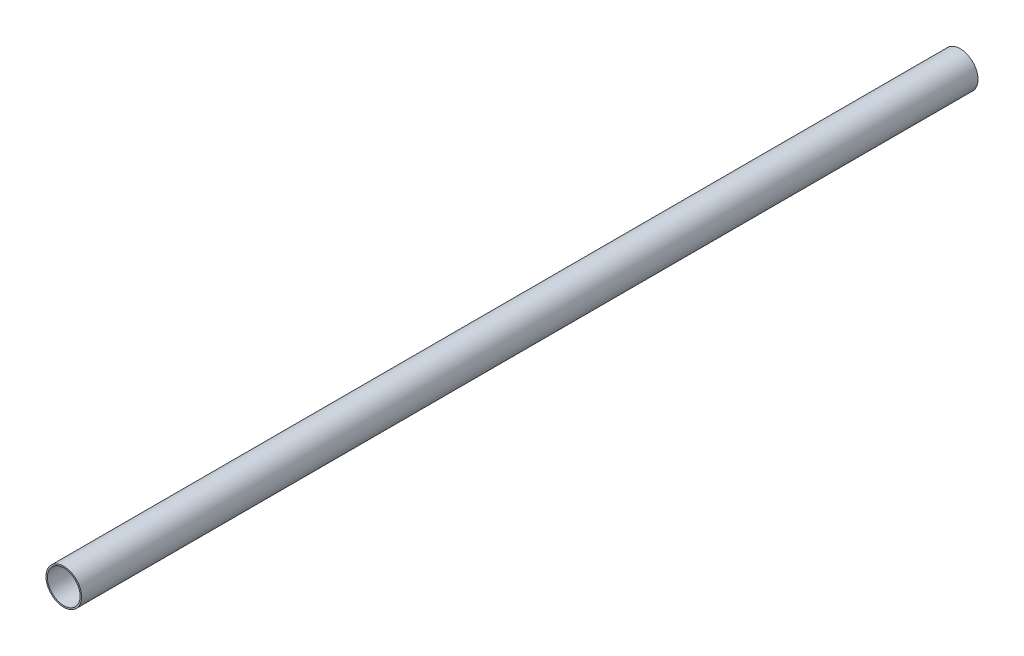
ISO-10303-21;
HEADER;
FILE_DESCRIPTION(('STEP AP214'),'2;1');
FILE_NAME('part.step','',(''),(''),'','','');
FILE_SCHEMA(('AUTOMOTIVE_DESIGN { 1 0 10303 214 1 1 1 1 }'));
ENDSEC;
DATA;
#1=APPLICATION_CONTEXT('core data for automotive mechanical design processes');
#2=APPLICATION_PROTOCOL_DEFINITION('international standard','automotive_design',2000,#1);
#3=PRODUCT_CONTEXT('',#1,'mechanical');
#4=PRODUCT('Part','Part','',(#3));
#5=PRODUCT_RELATED_PRODUCT_CATEGORY('part','',(#4));
#6=PRODUCT_DEFINITION_FORMATION('','',#4);
#7=PRODUCT_DEFINITION_CONTEXT('part definition',#1,'design');
#8=PRODUCT_DEFINITION('design','',#6,#7);
#9=PRODUCT_DEFINITION_SHAPE('','',#8);
#10=(LENGTH_UNIT() NAMED_UNIT(*) SI_UNIT(.MILLI.,.METRE.));
#11=(NAMED_UNIT(*) PLANE_ANGLE_UNIT() SI_UNIT($,.RADIAN.));
#12=(NAMED_UNIT(*) SI_UNIT($,.STERADIAN.) SOLID_ANGLE_UNIT());
#13=UNCERTAINTY_MEASURE_WITH_UNIT(LENGTH_MEASURE(1.E-05),#10,'distance_accuracy_value','');
#14=(GEOMETRIC_REPRESENTATION_CONTEXT(3) GLOBAL_UNCERTAINTY_ASSIGNED_CONTEXT((#13)) GLOBAL_UNIT_ASSIGNED_CONTEXT((#10,
#11,#12)) REPRESENTATION_CONTEXT('',''));
#15=CARTESIAN_POINT('',(0.,0.,0.));
#16=DIRECTION('',(0.,0.,1.));
#17=DIRECTION('',(1.,0.,0.));
#18=AXIS2_PLACEMENT_3D('',#15,#16,#17);
#19=CARTESIAN_POINT('',(0.,0.,630.));
#20=DIRECTION('',(0.,0.,1.));
#21=DIRECTION('',(1.,0.,0.));
#22=AXIS2_PLACEMENT_3D('',#19,#20,#21);
#23=PLANE('',#22);
#24=CARTESIAN_POINT('',(0.,0.,630.));
#25=DIRECTION('',(0.,0.,1.));
#26=DIRECTION('',(1.,0.,0.));
#27=AXIS2_PLACEMENT_3D('',#24,#25,#26);
#28=CIRCLE('',#27,12.5);
#29=CARTESIAN_POINT('',(12.5,0.,630.));
#30=VERTEX_POINT('',#29);
#31=EDGE_CURVE('E10',#30,#30,#28,.T.);
#32=ORIENTED_EDGE('',*,*,#31,.T.);
#33=EDGE_LOOP('',(#32));
#34=FACE_BOUND('',#33,.T.);
#35=CARTESIAN_POINT('',(0.,0.,630.));
#36=DIRECTION('',(0.,0.,1.));
#37=DIRECTION('',(1.,0.,0.));
#38=AXIS2_PLACEMENT_3D('',#35,#36,#37);
#39=CIRCLE('',#38,11.5);
#40=CARTESIAN_POINT('',(11.5,0.,630.));
#41=VERTEX_POINT('',#40);
#42=EDGE_CURVE('E43',#41,#41,#39,.T.);
#43=ORIENTED_EDGE('',*,*,#42,.F.);
#44=EDGE_LOOP('',(#43));
#45=FACE_BOUND('',#44,.T.);
#46=ADVANCED_FACE('F32',(#34,#45),#23,.T.);
#47=CARTESIAN_POINT('',(0.,0.,0.));
#48=DIRECTION('',(0.,0.,1.));
#49=DIRECTION('',(1.,0.,0.));
#50=AXIS2_PLACEMENT_3D('',#47,#48,#49);
#51=PLANE('',#50);
#52=CARTESIAN_POINT('',(0.,0.,0.));
#53=DIRECTION('',(0.,0.,1.));
#54=DIRECTION('',(1.,0.,0.));
#55=AXIS2_PLACEMENT_3D('',#52,#53,#54);
#56=CIRCLE('',#55,12.5);
#57=CARTESIAN_POINT('',(12.5,0.,0.));
#58=VERTEX_POINT('',#57);
#59=EDGE_CURVE('E39',#58,#58,#56,.T.);
#60=ORIENTED_EDGE('',*,*,#59,.F.);
#61=EDGE_LOOP('',(#60));
#62=FACE_BOUND('',#61,.T.);
#63=CARTESIAN_POINT('',(0.,0.,0.));
#64=DIRECTION('',(0.,0.,1.));
#65=DIRECTION('',(1.,0.,0.));
#66=AXIS2_PLACEMENT_3D('',#63,#64,#65);
#67=CIRCLE('',#66,11.5);
#68=CARTESIAN_POINT('',(11.5,0.,0.));
#69=VERTEX_POINT('',#68);
#70=EDGE_CURVE('E47',#69,#69,#67,.T.);
#71=ORIENTED_EDGE('',*,*,#70,.T.);
#72=EDGE_LOOP('',(#71));
#73=FACE_BOUND('',#72,.T.);
#74=ADVANCED_FACE('F53',(#62,#73),#51,.F.);
#75=CARTESIAN_POINT('',(0.,0.,630.));
#76=DIRECTION('',(0.,0.,-1.));
#77=DIRECTION('',(-1.,0.,0.));
#78=AXIS2_PLACEMENT_3D('',#75,#76,#77);
#79=CYLINDRICAL_SURFACE('',#78,12.5);
#80=ORIENTED_EDGE('',*,*,#31,.F.);
#81=EDGE_LOOP('',(#80));
#82=FACE_BOUND('',#81,.T.);
#83=ORIENTED_EDGE('',*,*,#59,.T.);
#84=EDGE_LOOP('',(#83));
#85=FACE_BOUND('',#84,.T.);
#86=ADVANCED_FACE('F34',(#82,#85),#79,.T.);
#87=CARTESIAN_POINT('',(0.,0.,630.));
#88=DIRECTION('',(0.,0.,-1.));
#89=DIRECTION('',(-1.,0.,0.));
#90=AXIS2_PLACEMENT_3D('',#87,#88,#89);
#91=CYLINDRICAL_SURFACE('',#90,11.5);
#92=ORIENTED_EDGE('',*,*,#42,.T.);
#93=EDGE_LOOP('',(#92));
#94=FACE_BOUND('',#93,.T.);
#95=ORIENTED_EDGE('',*,*,#70,.F.);
#96=EDGE_LOOP('',(#95));
#97=FACE_BOUND('',#96,.T.);
#98=ADVANCED_FACE('F55',(#94,#97),#91,.F.);
#99=CLOSED_SHELL('',(#46,#74,#86,#98));
#100=MANIFOLD_SOLID_BREP('B2',#99);
#101=ADVANCED_BREP_SHAPE_REPRESENTATION('',(#18,#100),#14);
#102=SHAPE_DEFINITION_REPRESENTATION(#9,#101);
ENDSEC;
END-ISO-10303-21;
